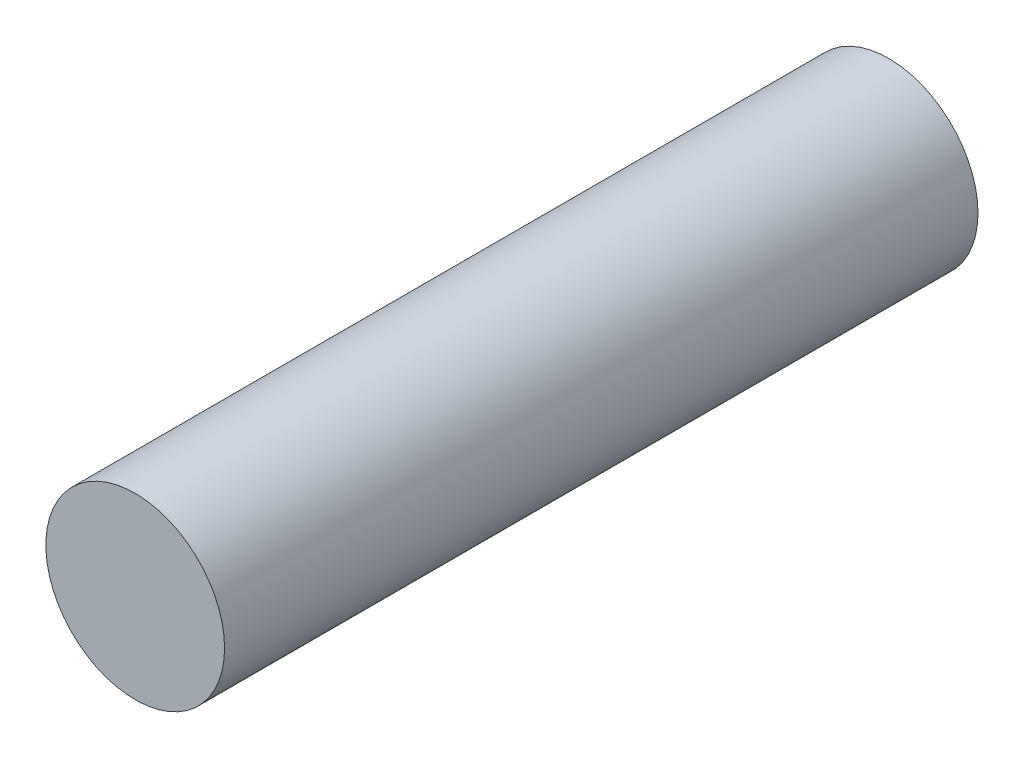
from build123d import *

# Parameters (mm, degrees)
SKETCH1_R           = 0.6477
BOSS_EXTRUDE1_DEPTH = 5.461


with BuildPart() as part:
    # Sketch1 → Boss-Extrude1 (new body)
    with BuildSketch(Plane.XY):
        Circle(SKETCH1_R)
    extrude(amount=BOSS_EXTRUDE1_DEPTH)


solid = part.part
